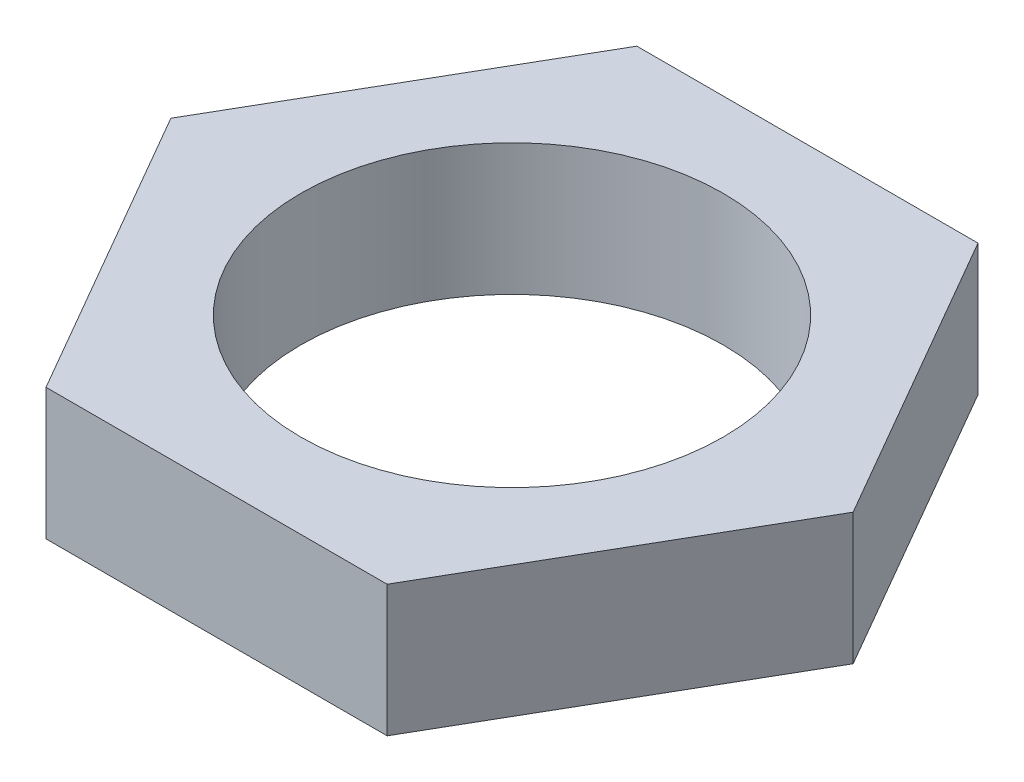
ISO-10303-21;
HEADER;
FILE_DESCRIPTION(('STEP AP214'),'2;1');
FILE_NAME('part.step','',(''),(''),'','','');
FILE_SCHEMA(('AUTOMOTIVE_DESIGN { 1 0 10303 214 1 1 1 1 }'));
ENDSEC;
DATA;
#1=APPLICATION_CONTEXT('core data for automotive mechanical design processes');
#2=APPLICATION_PROTOCOL_DEFINITION('international standard','automotive_design',2000,#1);
#3=PRODUCT_CONTEXT('',#1,'mechanical');
#4=PRODUCT('Part','Part','',(#3));
#5=PRODUCT_RELATED_PRODUCT_CATEGORY('part','',(#4));
#6=PRODUCT_DEFINITION_FORMATION('','',#4);
#7=PRODUCT_DEFINITION_CONTEXT('part definition',#1,'design');
#8=PRODUCT_DEFINITION('design','',#6,#7);
#9=PRODUCT_DEFINITION_SHAPE('','',#8);
#10=(LENGTH_UNIT() NAMED_UNIT(*) SI_UNIT(.MILLI.,.METRE.));
#11=(NAMED_UNIT(*) PLANE_ANGLE_UNIT() SI_UNIT($,.RADIAN.));
#12=(NAMED_UNIT(*) SI_UNIT($,.STERADIAN.) SOLID_ANGLE_UNIT());
#13=UNCERTAINTY_MEASURE_WITH_UNIT(LENGTH_MEASURE(1.E-05),#10,'distance_accuracy_value','');
#14=(GEOMETRIC_REPRESENTATION_CONTEXT(3) GLOBAL_UNCERTAINTY_ASSIGNED_CONTEXT((#13)) GLOBAL_UNIT_ASSIGNED_CONTEXT((#10,
#11,#12)) REPRESENTATION_CONTEXT('',''));
#15=CARTESIAN_POINT('',(0.,0.,0.));
#16=DIRECTION('',(0.,0.,1.));
#17=DIRECTION('',(1.,0.,0.));
#18=AXIS2_PLACEMENT_3D('',#15,#16,#17);
#19=CARTESIAN_POINT('',(7.79422863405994,6.,13.5));
#20=DIRECTION('',(0.,1.,0.));
#21=DIRECTION('',(0.,0.,1.));
#22=AXIS2_PLACEMENT_3D('',#19,#20,#21);
#23=PLANE('',#22);
#24=DIRECTION('',(1.,0.,0.));
#25=VECTOR('',#24,1.);
#26=CARTESIAN_POINT('',(-7.79422863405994,6.,13.5));
#27=LINE('',#26,#25);
#28=CARTESIAN_POINT('',(-7.79422863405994,6.,13.5));
#29=VERTEX_POINT('',#28);
#30=CARTESIAN_POINT('',(7.79422863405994,6.,13.5));
#31=VERTEX_POINT('',#30);
#32=EDGE_CURVE('E133',#29,#31,#27,.T.);
#33=ORIENTED_EDGE('',*,*,#32,.T.);
#34=DIRECTION('',(0.5,0.,-0.866025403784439));
#35=VECTOR('',#34,1.);
#36=CARTESIAN_POINT('',(7.79422863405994,6.,13.5));
#37=LINE('',#36,#35);
#38=CARTESIAN_POINT('',(15.5884572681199,6.,0.));
#39=VERTEX_POINT('',#38);
#40=EDGE_CURVE('E91',#31,#39,#37,.T.);
#41=ORIENTED_EDGE('',*,*,#40,.T.);
#42=DIRECTION('',(-0.5,0.,-0.866025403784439));
#43=VECTOR('',#42,1.);
#44=CARTESIAN_POINT('',(15.5884572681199,6.,0.));
#45=LINE('',#44,#43);
#46=CARTESIAN_POINT('',(7.79422863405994,6.,-13.5));
#47=VERTEX_POINT('',#46);
#48=EDGE_CURVE('E104',#39,#47,#45,.T.);
#49=ORIENTED_EDGE('',*,*,#48,.T.);
#50=DIRECTION('',(-1.,0.,0.));
#51=VECTOR('',#50,1.);
#52=CARTESIAN_POINT('',(7.79422863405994,6.,-13.5));
#53=LINE('',#52,#51);
#54=CARTESIAN_POINT('',(-7.79422863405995,6.,-13.5));
#55=VERTEX_POINT('',#54);
#56=EDGE_CURVE('E98',#47,#55,#53,.T.);
#57=ORIENTED_EDGE('',*,*,#56,.T.);
#58=DIRECTION('',(-0.5,0.,0.866025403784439));
#59=VECTOR('',#58,1.);
#60=CARTESIAN_POINT('',(-7.79422863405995,6.,-13.5));
#61=LINE('',#60,#59);
#62=CARTESIAN_POINT('',(-15.5884572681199,6.,0.));
#63=VERTEX_POINT('',#62);
#64=EDGE_CURVE('E102',#55,#63,#61,.T.);
#65=ORIENTED_EDGE('',*,*,#64,.T.);
#66=DIRECTION('',(0.5,0.,0.866025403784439));
#67=VECTOR('',#66,1.);
#68=CARTESIAN_POINT('',(-15.5884572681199,6.,0.));
#69=LINE('',#68,#67);
#70=EDGE_CURVE('E54',#63,#29,#69,.T.);
#71=ORIENTED_EDGE('',*,*,#70,.T.);
#72=EDGE_LOOP('',(#33,#41,#49,#57,#65,#71));
#73=FACE_BOUND('',#72,.T.);
#74=CARTESIAN_POINT('',(0.,6.,0.));
#75=DIRECTION('',(0.,1.,0.));
#76=DIRECTION('',(0.,0.,1.));
#77=AXIS2_PLACEMENT_3D('',#74,#75,#76);
#78=CIRCLE('',#77,9.65);
#79=CARTESIAN_POINT('',(0.,6.,9.65));
#80=VERTEX_POINT('',#79);
#81=EDGE_CURVE('E126',#80,#80,#78,.T.);
#82=ORIENTED_EDGE('',*,*,#81,.F.);
#83=EDGE_LOOP('',(#82));
#84=FACE_BOUND('',#83,.T.);
#85=ADVANCED_FACE('F37',(#73,#84),#23,.T.);
#86=CARTESIAN_POINT('',(7.79422863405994,0.,13.5));
#87=DIRECTION('',(0.,1.,0.));
#88=DIRECTION('',(0.,0.,1.));
#89=AXIS2_PLACEMENT_3D('',#86,#87,#88);
#90=PLANE('',#89);
#91=DIRECTION('',(1.,0.,0.));
#92=VECTOR('',#91,1.);
#93=CARTESIAN_POINT('',(-7.79422863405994,0.,13.5));
#94=LINE('',#93,#92);
#95=CARTESIAN_POINT('',(-7.79422863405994,0.,13.5));
#96=VERTEX_POINT('',#95);
#97=CARTESIAN_POINT('',(7.79422863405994,0.,13.5));
#98=VERTEX_POINT('',#97);
#99=EDGE_CURVE('E122',#96,#98,#94,.T.);
#100=ORIENTED_EDGE('',*,*,#99,.F.);
#101=DIRECTION('',(0.5,0.,0.866025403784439));
#102=VECTOR('',#101,1.);
#103=CARTESIAN_POINT('',(-15.5884572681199,0.,0.));
#104=LINE('',#103,#102);
#105=CARTESIAN_POINT('',(-15.5884572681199,0.,0.));
#106=VERTEX_POINT('',#105);
#107=EDGE_CURVE('E83',#106,#96,#104,.T.);
#108=ORIENTED_EDGE('',*,*,#107,.F.);
#109=DIRECTION('',(-0.5,0.,0.866025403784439));
#110=VECTOR('',#109,1.);
#111=CARTESIAN_POINT('',(-7.79422863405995,0.,-13.5));
#112=LINE('',#111,#110);
#113=CARTESIAN_POINT('',(-7.79422863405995,0.,-13.5));
#114=VERTEX_POINT('',#113);
#115=EDGE_CURVE('E77',#114,#106,#112,.T.);
#116=ORIENTED_EDGE('',*,*,#115,.F.);
#117=DIRECTION('',(-1.,0.,0.));
#118=VECTOR('',#117,1.);
#119=CARTESIAN_POINT('',(7.79422863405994,0.,-13.5));
#120=LINE('',#119,#118);
#121=CARTESIAN_POINT('',(7.79422863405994,0.,-13.5));
#122=VERTEX_POINT('',#121);
#123=EDGE_CURVE('E112',#122,#114,#120,.T.);
#124=ORIENTED_EDGE('',*,*,#123,.F.);
#125=DIRECTION('',(-0.5,0.,-0.866025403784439));
#126=VECTOR('',#125,1.);
#127=CARTESIAN_POINT('',(15.5884572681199,0.,0.));
#128=LINE('',#127,#126);
#129=CARTESIAN_POINT('',(15.5884572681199,0.,0.));
#130=VERTEX_POINT('',#129);
#131=EDGE_CURVE('E128',#130,#122,#128,.T.);
#132=ORIENTED_EDGE('',*,*,#131,.F.);
#133=DIRECTION('',(0.5,0.,-0.866025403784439));
#134=VECTOR('',#133,1.);
#135=CARTESIAN_POINT('',(7.79422863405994,0.,13.5));
#136=LINE('',#135,#134);
#137=EDGE_CURVE('E125',#98,#130,#136,.T.);
#138=ORIENTED_EDGE('',*,*,#137,.F.);
#139=EDGE_LOOP('',(#100,#108,#116,#124,#132,#138));
#140=FACE_BOUND('',#139,.T.);
#141=CARTESIAN_POINT('',(0.,0.,0.));
#142=DIRECTION('',(0.,1.,0.));
#143=DIRECTION('',(0.,0.,1.));
#144=AXIS2_PLACEMENT_3D('',#141,#142,#143);
#145=CIRCLE('',#144,9.65);
#146=CARTESIAN_POINT('',(0.,0.,9.65));
#147=VERTEX_POINT('',#146);
#148=EDGE_CURVE('E226',#147,#147,#145,.T.);
#149=ORIENTED_EDGE('',*,*,#148,.T.);
#150=EDGE_LOOP('',(#149));
#151=FACE_BOUND('',#150,.T.);
#152=ADVANCED_FACE('F142',(#140,#151),#90,.F.);
#153=CARTESIAN_POINT('',(-7.79422863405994,6.,13.5));
#154=DIRECTION('',(0.,0.,-1.));
#155=DIRECTION('',(-1.,0.,0.));
#156=AXIS2_PLACEMENT_3D('',#153,#154,#155);
#157=PLANE('',#156);
#158=ORIENTED_EDGE('',*,*,#99,.T.);
#159=DIRECTION('',(0.,-1.,0.));
#160=VECTOR('',#159,1.);
#161=CARTESIAN_POINT('',(7.79422863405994,6.,13.5));
#162=LINE('',#161,#160);
#163=EDGE_CURVE('E11',#31,#98,#162,.T.);
#164=ORIENTED_EDGE('',*,*,#163,.F.);
#165=ORIENTED_EDGE('',*,*,#32,.F.);
#166=DIRECTION('',(0.,-1.,0.));
#167=VECTOR('',#166,1.);
#168=CARTESIAN_POINT('',(-7.79422863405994,6.,13.5));
#169=LINE('',#168,#167);
#170=EDGE_CURVE('E118',#29,#96,#169,.T.);
#171=ORIENTED_EDGE('',*,*,#170,.T.);
#172=EDGE_LOOP('',(#158,#164,#165,#171));
#173=FACE_BOUND('',#172,.T.);
#174=ADVANCED_FACE('F39',(#173),#157,.F.);
#175=CARTESIAN_POINT('',(7.79422863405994,6.,13.5));
#176=DIRECTION('',(-0.866025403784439,0.,-0.5));
#177=DIRECTION('',(-0.5,0.,0.866025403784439));
#178=AXIS2_PLACEMENT_3D('',#175,#176,#177);
#179=PLANE('',#178);
#180=ORIENTED_EDGE('',*,*,#137,.T.);
#181=DIRECTION('',(0.,-1.,0.));
#182=VECTOR('',#181,1.);
#183=CARTESIAN_POINT('',(15.5884572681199,6.,0.));
#184=LINE('',#183,#182);
#185=EDGE_CURVE('E46',#39,#130,#184,.T.);
#186=ORIENTED_EDGE('',*,*,#185,.F.);
#187=ORIENTED_EDGE('',*,*,#40,.F.);
#188=ORIENTED_EDGE('',*,*,#163,.T.);
#189=EDGE_LOOP('',(#180,#186,#187,#188));
#190=FACE_BOUND('',#189,.T.);
#191=ADVANCED_FACE('F167',(#190),#179,.F.);
#192=CARTESIAN_POINT('',(15.5884572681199,6.,0.));
#193=DIRECTION('',(-0.866025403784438,0.,0.5));
#194=DIRECTION('',(0.5,0.,0.866025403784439));
#195=AXIS2_PLACEMENT_3D('',#192,#193,#194);
#196=PLANE('',#195);
#197=ORIENTED_EDGE('',*,*,#131,.T.);
#198=DIRECTION('',(0.,-1.,0.));
#199=VECTOR('',#198,1.);
#200=CARTESIAN_POINT('',(7.79422863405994,6.,-13.5));
#201=LINE('',#200,#199);
#202=EDGE_CURVE('E113',#47,#122,#201,.T.);
#203=ORIENTED_EDGE('',*,*,#202,.F.);
#204=ORIENTED_EDGE('',*,*,#48,.F.);
#205=ORIENTED_EDGE('',*,*,#185,.T.);
#206=EDGE_LOOP('',(#197,#203,#204,#205));
#207=FACE_BOUND('',#206,.T.);
#208=ADVANCED_FACE('F139',(#207),#196,.F.);
#209=CARTESIAN_POINT('',(7.79422863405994,6.,-13.5));
#210=DIRECTION('',(0.,0.,1.));
#211=DIRECTION('',(1.,0.,0.));
#212=AXIS2_PLACEMENT_3D('',#209,#210,#211);
#213=PLANE('',#212);
#214=ORIENTED_EDGE('',*,*,#123,.T.);
#215=DIRECTION('',(0.,-1.,0.));
#216=VECTOR('',#215,1.);
#217=CARTESIAN_POINT('',(-7.79422863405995,6.,-13.5));
#218=LINE('',#217,#216);
#219=EDGE_CURVE('E109',#55,#114,#218,.T.);
#220=ORIENTED_EDGE('',*,*,#219,.F.);
#221=ORIENTED_EDGE('',*,*,#56,.F.);
#222=ORIENTED_EDGE('',*,*,#202,.T.);
#223=EDGE_LOOP('',(#214,#220,#221,#222));
#224=FACE_BOUND('',#223,.T.);
#225=ADVANCED_FACE('F110',(#224),#213,.F.);
#226=CARTESIAN_POINT('',(-7.79422863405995,6.,-13.5));
#227=DIRECTION('',(0.866025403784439,0.,0.5));
#228=DIRECTION('',(0.5,0.,-0.866025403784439));
#229=AXIS2_PLACEMENT_3D('',#226,#227,#228);
#230=PLANE('',#229);
#231=ORIENTED_EDGE('',*,*,#115,.T.);
#232=DIRECTION('',(0.,-1.,0.));
#233=VECTOR('',#232,1.);
#234=CARTESIAN_POINT('',(-15.5884572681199,6.,0.));
#235=LINE('',#234,#233);
#236=EDGE_CURVE('E114',#63,#106,#235,.T.);
#237=ORIENTED_EDGE('',*,*,#236,.F.);
#238=ORIENTED_EDGE('',*,*,#64,.F.);
#239=ORIENTED_EDGE('',*,*,#219,.T.);
#240=EDGE_LOOP('',(#231,#237,#238,#239));
#241=FACE_BOUND('',#240,.T.);
#242=ADVANCED_FACE('F116',(#241),#230,.F.);
#243=CARTESIAN_POINT('',(-15.5884572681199,6.,0.));
#244=DIRECTION('',(0.866025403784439,0.,-0.5));
#245=DIRECTION('',(-0.5,0.,-0.866025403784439));
#246=AXIS2_PLACEMENT_3D('',#243,#244,#245);
#247=PLANE('',#246);
#248=ORIENTED_EDGE('',*,*,#107,.T.);
#249=ORIENTED_EDGE('',*,*,#170,.F.);
#250=ORIENTED_EDGE('',*,*,#70,.F.);
#251=ORIENTED_EDGE('',*,*,#236,.T.);
#252=EDGE_LOOP('',(#248,#249,#250,#251));
#253=FACE_BOUND('',#252,.T.);
#254=ADVANCED_FACE('F147',(#253),#247,.F.);
#255=CARTESIAN_POINT('',(0.,6.,0.));
#256=DIRECTION('',(0.,-1.,0.));
#257=DIRECTION('',(0.,0.,-1.));
#258=AXIS2_PLACEMENT_3D('',#255,#256,#257);
#259=CYLINDRICAL_SURFACE('',#258,9.65);
#260=ORIENTED_EDGE('',*,*,#81,.T.);
#261=EDGE_LOOP('',(#260));
#262=FACE_BOUND('',#261,.T.);
#263=ORIENTED_EDGE('',*,*,#148,.F.);
#264=EDGE_LOOP('',(#263));
#265=FACE_BOUND('',#264,.T.);
#266=ADVANCED_FACE('F149',(#262,#265),#259,.F.);
#267=CLOSED_SHELL('',(#85,#152,#174,#191,#208,#225,#242,#254,#266));
#268=MANIFOLD_SOLID_BREP('B2',#267);
#269=ADVANCED_BREP_SHAPE_REPRESENTATION('',(#18,#268),#14);
#270=SHAPE_DEFINITION_REPRESENTATION(#9,#269);
ENDSEC;
END-ISO-10303-21;
